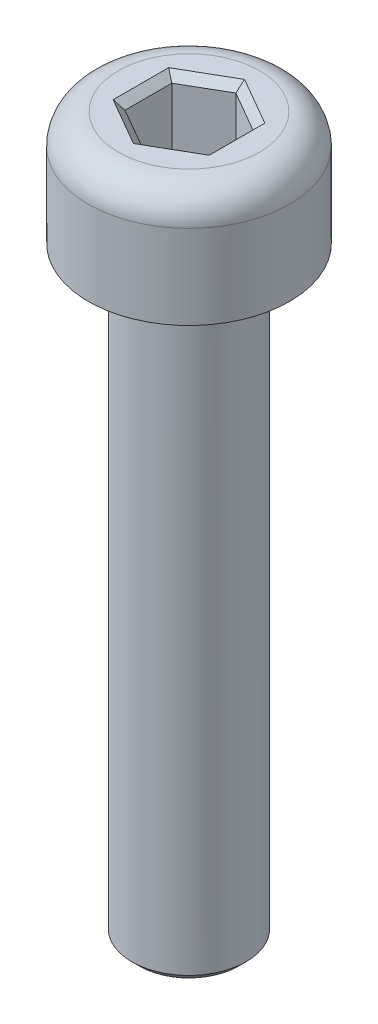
ISO-10303-21;
HEADER;
FILE_DESCRIPTION(('STEP AP214'),'2;1');
FILE_NAME('part.step','',(''),(''),'','','');
FILE_SCHEMA(('AUTOMOTIVE_DESIGN { 1 0 10303 214 1 1 1 1 }'));
ENDSEC;
DATA;
#1=APPLICATION_CONTEXT('core data for automotive mechanical design processes');
#2=APPLICATION_PROTOCOL_DEFINITION('international standard','automotive_design',2000,#1);
#3=PRODUCT_CONTEXT('',#1,'mechanical');
#4=PRODUCT('Part','Part','',(#3));
#5=PRODUCT_RELATED_PRODUCT_CATEGORY('part','',(#4));
#6=PRODUCT_DEFINITION_FORMATION('','',#4);
#7=PRODUCT_DEFINITION_CONTEXT('part definition',#1,'design');
#8=PRODUCT_DEFINITION('design','',#6,#7);
#9=PRODUCT_DEFINITION_SHAPE('','',#8);
#10=(LENGTH_UNIT() NAMED_UNIT(*) SI_UNIT(.MILLI.,.METRE.));
#11=(NAMED_UNIT(*) PLANE_ANGLE_UNIT() SI_UNIT($,.RADIAN.));
#12=(NAMED_UNIT(*) SI_UNIT($,.STERADIAN.) SOLID_ANGLE_UNIT());
#13=UNCERTAINTY_MEASURE_WITH_UNIT(LENGTH_MEASURE(1.E-05),#10,'distance_accuracy_value','');
#14=(GEOMETRIC_REPRESENTATION_CONTEXT(3) GLOBAL_UNCERTAINTY_ASSIGNED_CONTEXT((#13)) GLOBAL_UNIT_ASSIGNED_CONTEXT((#10,
#11,#12)) REPRESENTATION_CONTEXT('',''));
#15=CARTESIAN_POINT('',(0.,0.,0.));
#16=DIRECTION('',(0.,0.,1.));
#17=DIRECTION('',(1.,0.,0.));
#18=AXIS2_PLACEMENT_3D('',#15,#16,#17);
#19=CARTESIAN_POINT('',(0.,0.,0.));
#20=DIRECTION('',(0.,1.,0.));
#21=DIRECTION('',(0.,0.,1.));
#22=AXIS2_PLACEMENT_3D('',#19,#20,#21);
#23=PLANE('',#22);
#24=CARTESIAN_POINT('',(0.,0.,0.));
#25=DIRECTION('',(0.,1.,0.));
#26=DIRECTION('',(0.,0.,1.));
#27=AXIS2_PLACEMENT_3D('',#24,#25,#26);
#28=CIRCLE('',#27,3.35);
#29=CARTESIAN_POINT('',(0.,0.,-3.35));
#30=VERTEX_POINT('',#29);
#31=EDGE_CURVE('E141',#30,#30,#28,.T.);
#32=ORIENTED_EDGE('',*,*,#31,.F.);
#33=EDGE_LOOP('',(#32));
#34=FACE_BOUND('',#33,.T.);
#35=CARTESIAN_POINT('',(0.,0.,0.));
#36=DIRECTION('',(0.,1.,0.));
#37=DIRECTION('',(0.,0.,1.));
#38=AXIS2_PLACEMENT_3D('',#35,#36,#37);
#39=CIRCLE('',#38,1.9);
#40=CARTESIAN_POINT('',(0.,0.,1.9));
#41=VERTEX_POINT('',#40);
#42=EDGE_CURVE('E159',#41,#41,#39,.F.);
#43=ORIENTED_EDGE('',*,*,#42,.F.);
#44=EDGE_LOOP('',(#43));
#45=FACE_BOUND('',#44,.T.);
#46=ADVANCED_FACE('F33',(#34,#45),#23,.F.);
#47=CARTESIAN_POINT('',(0.,3.8,0.));
#48=DIRECTION('',(0.,-1.,0.));
#49=DIRECTION('',(0.,0.,-1.));
#50=AXIS2_PLACEMENT_3D('',#47,#48,#49);
#51=CYLINDRICAL_SURFACE('',#50,3.35);
#52=CARTESIAN_POINT('',(0.,2.8,0.));
#53=DIRECTION('',(0.,1.,0.));
#54=DIRECTION('',(0.,0.,1.));
#55=AXIS2_PLACEMENT_3D('',#52,#53,#54);
#56=CIRCLE('',#55,3.35);
#57=CARTESIAN_POINT('',(0.,2.8,-3.35));
#58=VERTEX_POINT('',#57);
#59=EDGE_CURVE('E156',#58,#58,#56,.F.);
#60=CARTESIAN_POINT('',(0.,2.8,-3.35));
#61=CARTESIAN_POINT('',(0.,2.77083333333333,-3.35));
#62=CARTESIAN_POINT('',(0.,2.74166666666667,-3.35));
#63=CARTESIAN_POINT('',(0.,2.68333333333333,-3.35));
#64=CARTESIAN_POINT('',(0.,2.65416666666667,-3.35));
#65=CARTESIAN_POINT('',(0.,2.59583333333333,-3.35));
#66=CARTESIAN_POINT('',(0.,2.56666666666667,-3.35));
#67=CARTESIAN_POINT('',(0.,2.50833333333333,-3.35));
#68=CARTESIAN_POINT('',(0.,2.47916666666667,-3.35));
#69=CARTESIAN_POINT('',(0.,2.42083333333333,-3.35));
#70=CARTESIAN_POINT('',(0.,2.39166666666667,-3.35));
#71=CARTESIAN_POINT('',(0.,2.33333333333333,-3.35));
#72=CARTESIAN_POINT('',(0.,2.30416666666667,-3.35));
#73=CARTESIAN_POINT('',(0.,2.24583333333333,-3.35));
#74=CARTESIAN_POINT('',(0.,2.21666666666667,-3.35));
#75=CARTESIAN_POINT('',(0.,2.15833333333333,-3.35));
#76=CARTESIAN_POINT('',(0.,2.12916666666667,-3.35));
#77=CARTESIAN_POINT('',(0.,2.07083333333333,-3.35));
#78=CARTESIAN_POINT('',(0.,2.04166666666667,-3.35));
#79=CARTESIAN_POINT('',(0.,1.98333333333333,-3.35));
#80=CARTESIAN_POINT('',(0.,1.95416666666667,-3.35));
#81=CARTESIAN_POINT('',(0.,1.89583333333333,-3.35));
#82=CARTESIAN_POINT('',(0.,1.86666666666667,-3.35));
#83=CARTESIAN_POINT('',(0.,1.80833333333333,-3.35));
#84=CARTESIAN_POINT('',(0.,1.77916666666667,-3.35));
#85=CARTESIAN_POINT('',(0.,1.72083333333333,-3.35));
#86=CARTESIAN_POINT('',(0.,1.69166666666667,-3.35));
#87=CARTESIAN_POINT('',(0.,1.63333333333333,-3.35));
#88=CARTESIAN_POINT('',(0.,1.60416666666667,-3.35));
#89=CARTESIAN_POINT('',(0.,1.54583333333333,-3.35));
#90=CARTESIAN_POINT('',(0.,1.51666666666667,-3.35));
#91=CARTESIAN_POINT('',(0.,1.45833333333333,-3.35));
#92=CARTESIAN_POINT('',(0.,1.42916666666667,-3.35));
#93=CARTESIAN_POINT('',(0.,1.37083333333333,-3.35));
#94=CARTESIAN_POINT('',(0.,1.34166666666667,-3.35));
#95=CARTESIAN_POINT('',(0.,1.28333333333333,-3.35));
#96=CARTESIAN_POINT('',(0.,1.25416666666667,-3.35));
#97=CARTESIAN_POINT('',(0.,1.19583333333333,-3.35));
#98=CARTESIAN_POINT('',(0.,1.16666666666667,-3.35));
#99=CARTESIAN_POINT('',(0.,1.10833333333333,-3.35));
#100=CARTESIAN_POINT('',(0.,1.07916666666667,-3.35));
#101=CARTESIAN_POINT('',(0.,1.02083333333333,-3.35));
#102=CARTESIAN_POINT('',(0.,0.991666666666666,-3.35));
#103=CARTESIAN_POINT('',(0.,0.933333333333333,-3.35));
#104=CARTESIAN_POINT('',(0.,0.904166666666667,-3.35));
#105=CARTESIAN_POINT('',(0.,0.845833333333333,-3.35));
#106=CARTESIAN_POINT('',(0.,0.816666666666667,-3.35));
#107=CARTESIAN_POINT('',(0.,0.758333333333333,-3.35));
#108=CARTESIAN_POINT('',(0.,0.729166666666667,-3.35));
#109=CARTESIAN_POINT('',(0.,0.670833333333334,-3.35));
#110=CARTESIAN_POINT('',(0.,0.641666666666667,-3.35));
#111=CARTESIAN_POINT('',(0.,0.583333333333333,-3.35));
#112=CARTESIAN_POINT('',(0.,0.554166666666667,-3.35));
#113=CARTESIAN_POINT('',(0.,0.495833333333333,-3.35));
#114=CARTESIAN_POINT('',(0.,0.466666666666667,-3.35));
#115=CARTESIAN_POINT('',(0.,0.408333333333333,-3.35));
#116=CARTESIAN_POINT('',(0.,0.379166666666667,-3.35));
#117=CARTESIAN_POINT('',(0.,0.320833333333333,-3.35));
#118=CARTESIAN_POINT('',(0.,0.291666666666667,-3.35));
#119=CARTESIAN_POINT('',(0.,0.233333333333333,-3.35));
#120=CARTESIAN_POINT('',(0.,0.204166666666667,-3.35));
#121=CARTESIAN_POINT('',(0.,0.145833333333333,-3.35));
#122=CARTESIAN_POINT('',(0.,0.116666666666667,-3.35));
#123=CARTESIAN_POINT('',(0.,0.0583333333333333,-3.35));
#124=CARTESIAN_POINT('',(0.,0.0291666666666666,-3.35));
#125=CARTESIAN_POINT('',(0.,0.,-3.35));
#126=B_SPLINE_CURVE_WITH_KNOTS('',3,(#60,#61,#62,#63,#64,#65,#66,#67,#68,#69,#70,#71,#72,#73,
#74,#75,#76,#77,#78,#79,#80,#81,#82,#83,#84,#85,#86,#87,#88,#89,#90,#91,#92,#93,#94,#95,#96,#97,
#98,#99,#100,#101,#102,#103,#104,#105,#106,#107,#108,#109,#110,#111,#112,#113,#114,#115,#116,
#117,#118,#119,#120,#121,#122,#123,#124,#125),.UNSPECIFIED.,.F.,.F.,(4,2,2,2,2,2,2,2,2,2,2,2,2,
2,2,2,2,2,2,2,2,2,2,2,2,2,2,2,2,2,2,2,4),(0.,0.0874999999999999,0.175,0.2625,0.35,0.4375,
0.524999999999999,0.6125,0.7,0.7875,0.875,0.9625,1.05,1.1375,1.225,1.3125,1.4,1.4875,1.575,
1.6625,1.75,1.8375,1.925,2.0125,2.1,2.1875,2.275,2.3625,2.45,2.5375,2.625,2.7125,2.8),.UNSPECIFIED.);
#127=EDGE_CURVE('BSEAM213',#58,#30,#126,.T.);
#128=ORIENTED_EDGE('',*,*,#59,.T.);
#129=ORIENTED_EDGE('',*,*,#31,.T.);
#130=ORIENTED_EDGE('',*,*,#127,.T.);
#131=ORIENTED_EDGE('',*,*,#127,.F.);
#132=EDGE_LOOP('',(#128,#130,#129,#131));
#133=FACE_BOUND('',#132,.T.);
#134=ADVANCED_FACE('F213',(#133),#51,.T.);
#135=CARTESIAN_POINT('',(0.,3.8,0.));
#136=DIRECTION('',(0.,1.,0.));
#137=DIRECTION('',(0.,0.,1.));
#138=AXIS2_PLACEMENT_3D('',#135,#136,#137);
#139=PLANE('',#138);
#140=DIRECTION('',(-0.866025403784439,0.,-0.5));
#141=VECTOR('',#140,1.);
#142=CARTESIAN_POINT('',(-1.475,3.8,0.995929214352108));
#143=LINE('',#142,#141);
#144=CARTESIAN_POINT('',(0.,3.8,1.84752086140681));
#145=VERTEX_POINT('',#144);
#146=CARTESIAN_POINT('',(-1.6,3.8,0.923760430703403));
#147=VERTEX_POINT('',#146);
#148=EDGE_CURVE('E173',#145,#147,#143,.T.);
#149=ORIENTED_EDGE('',*,*,#148,.T.);
#150=DIRECTION('',(0.,0.,-1.));
#151=VECTOR('',#150,1.);
#152=CARTESIAN_POINT('',(-1.6,3.8,-0.779422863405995));
#153=LINE('',#152,#151);
#154=CARTESIAN_POINT('',(-1.6,3.8,-0.923760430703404));
#155=VERTEX_POINT('',#154);
#156=EDGE_CURVE('E175',#147,#155,#153,.T.);
#157=ORIENTED_EDGE('',*,*,#156,.T.);
#158=DIRECTION('',(0.866025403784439,0.,-0.5));
#159=VECTOR('',#158,1.);
#160=CARTESIAN_POINT('',(-0.125000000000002,3.8,-1.7753520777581));
#161=LINE('',#160,#159);
#162=CARTESIAN_POINT('',(0.,3.8,-1.84752086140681));
#163=VERTEX_POINT('',#162);
#164=EDGE_CURVE('E165',#155,#163,#161,.T.);
#165=ORIENTED_EDGE('',*,*,#164,.T.);
#166=DIRECTION('',(0.866025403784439,0.,0.5));
#167=VECTOR('',#166,1.);
#168=CARTESIAN_POINT('',(1.475,3.8,-0.995929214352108));
#169=LINE('',#168,#167);
#170=CARTESIAN_POINT('',(1.6,3.8,-0.923760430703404));
#171=VERTEX_POINT('',#170);
#172=EDGE_CURVE('E167',#163,#171,#169,.T.);
#173=ORIENTED_EDGE('',*,*,#172,.T.);
#174=DIRECTION('',(0.,0.,1.));
#175=VECTOR('',#174,1.);
#176=CARTESIAN_POINT('',(1.6,3.8,0.779422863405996));
#177=LINE('',#176,#175);
#178=CARTESIAN_POINT('',(1.6,3.8,0.923760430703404));
#179=VERTEX_POINT('',#178);
#180=EDGE_CURVE('E169',#171,#179,#177,.T.);
#181=ORIENTED_EDGE('',*,*,#180,.T.);
#182=DIRECTION('',(-0.866025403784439,0.,0.5));
#183=VECTOR('',#182,1.);
#184=CARTESIAN_POINT('',(0.125000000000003,3.8,1.7753520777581));
#185=LINE('',#184,#183);
#186=EDGE_CURVE('E171',#179,#145,#185,.T.);
#187=ORIENTED_EDGE('',*,*,#186,.T.);
#188=EDGE_LOOP('',(#149,#157,#165,#173,#181,#187));
#189=FACE_BOUND('',#188,.T.);
#190=CARTESIAN_POINT('',(0.,3.8,0.));
#191=DIRECTION('',(0.,1.,0.));
#192=DIRECTION('',(0.,0.,1.));
#193=AXIS2_PLACEMENT_3D('',#190,#191,#192);
#194=CIRCLE('',#193,2.35);
#195=CARTESIAN_POINT('',(0.,3.8,2.35));
#196=VERTEX_POINT('',#195);
#197=EDGE_CURVE('E153',#196,#196,#194,.T.);
#198=ORIENTED_EDGE('',*,*,#197,.T.);
#199=EDGE_LOOP('',(#198));
#200=FACE_BOUND('',#199,.T.);
#201=ADVANCED_FACE('F219',(#189,#200),#139,.T.);
#202=CARTESIAN_POINT('',(0.,2.8,0.));
#203=DIRECTION('',(0.,1.,0.));
#204=DIRECTION('',(0.,0.,1.));
#205=AXIS2_PLACEMENT_3D('',#202,#203,#204);
#206=TOROIDAL_SURFACE('',#205,2.35,1.);
#207=ORIENTED_EDGE('',*,*,#59,.F.);
#208=EDGE_LOOP('',(#207));
#209=FACE_BOUND('',#208,.T.);
#210=ORIENTED_EDGE('',*,*,#197,.F.);
#211=EDGE_LOOP('',(#210));
#212=FACE_BOUND('',#211,.T.);
#213=ADVANCED_FACE('F227',(#209,#212),#206,.T.);
#214=CARTESIAN_POINT('',(0.,-20.,0.));
#215=DIRECTION('',(0.,1.,0.));
#216=DIRECTION('',(0.,0.,1.));
#217=AXIS2_PLACEMENT_3D('',#214,#215,#216);
#218=CYLINDRICAL_SURFACE('',#217,1.9);
#219=CARTESIAN_POINT('',(0.,-19.75,0.));
#220=DIRECTION('',(0.,-1.,0.));
#221=DIRECTION('',(0.,0.,-1.));
#222=AXIS2_PLACEMENT_3D('',#219,#220,#221);
#223=CIRCLE('',#222,1.9);
#224=CARTESIAN_POINT('',(0.,-19.75,-1.9));
#225=VERTEX_POINT('',#224);
#226=EDGE_CURVE('E11',#225,#225,#223,.F.);
#227=ORIENTED_EDGE('',*,*,#226,.T.);
#228=EDGE_LOOP('',(#227));
#229=FACE_BOUND('',#228,.T.);
#230=ORIENTED_EDGE('',*,*,#42,.T.);
#231=EDGE_LOOP('',(#230));
#232=FACE_BOUND('',#231,.T.);
#233=ADVANCED_FACE('F229',(#229,#232),#218,.T.);
#234=CARTESIAN_POINT('',(0.,-20.,0.));
#235=DIRECTION('',(0.,-1.,0.));
#236=DIRECTION('',(0.,0.,-1.));
#237=AXIS2_PLACEMENT_3D('',#234,#235,#236);
#238=PLANE('',#237);
#239=CARTESIAN_POINT('',(0.,-20.,0.));
#240=DIRECTION('',(0.,-1.,0.));
#241=DIRECTION('',(0.,0.,-1.));
#242=AXIS2_PLACEMENT_3D('',#239,#240,#241);
#243=CIRCLE('',#242,1.65);
#244=CARTESIAN_POINT('',(0.,-20.,-1.65));
#245=VERTEX_POINT('',#244);
#246=EDGE_CURVE('E41',#245,#245,#243,.T.);
#247=ORIENTED_EDGE('',*,*,#246,.T.);
#248=EDGE_LOOP('',(#247));
#249=FACE_BOUND('',#248,.T.);
#250=ADVANCED_FACE('F200',(#249),#238,.T.);
#251=CARTESIAN_POINT('',(1.35,0.8,-0.779422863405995));
#252=DIRECTION('',(0.5,0.,-0.866025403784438));
#253=DIRECTION('',(-0.866025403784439,0.,-0.5));
#254=AXIS2_PLACEMENT_3D('',#251,#252,#253);
#255=PLANE('',#254);
#256=DIRECTION('',(0.,1.,0.));
#257=VECTOR('',#256,1.);
#258=CARTESIAN_POINT('',(1.35,0.8,-0.779422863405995));
#259=LINE('',#258,#257);
#260=CARTESIAN_POINT('',(1.35,0.8,-0.779422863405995));
#261=VERTEX_POINT('',#260);
#262=CARTESIAN_POINT('',(1.35,3.55,-0.779422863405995));
#263=VERTEX_POINT('',#262);
#264=EDGE_CURVE('E139',#261,#263,#259,.T.);
#265=ORIENTED_EDGE('',*,*,#264,.T.);
#266=DIRECTION('',(-0.866025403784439,0.,-0.5));
#267=VECTOR('',#266,1.);
#268=CARTESIAN_POINT('',(0.,3.55,-1.55884572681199));
#269=LINE('',#268,#267);
#270=CARTESIAN_POINT('',(0.,3.55,-1.55884572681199));
#271=VERTEX_POINT('',#270);
#272=EDGE_CURVE('E48',#263,#271,#269,.T.);
#273=ORIENTED_EDGE('',*,*,#272,.T.);
#274=DIRECTION('',(0.,1.,0.));
#275=VECTOR('',#274,1.);
#276=CARTESIAN_POINT('',(0.,0.8,-1.55884572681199));
#277=LINE('',#276,#275);
#278=CARTESIAN_POINT('',(0.,0.8,-1.55884572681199));
#279=VERTEX_POINT('',#278);
#280=EDGE_CURVE('E103',#279,#271,#277,.T.);
#281=ORIENTED_EDGE('',*,*,#280,.F.);
#282=DIRECTION('',(-0.866025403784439,0.,-0.5));
#283=VECTOR('',#282,1.);
#284=CARTESIAN_POINT('',(1.35,0.8,-0.779422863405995));
#285=LINE('',#284,#283);
#286=EDGE_CURVE('E107',#261,#279,#285,.T.);
#287=ORIENTED_EDGE('',*,*,#286,.F.);
#288=EDGE_LOOP('',(#265,#273,#281,#287));
#289=FACE_BOUND('',#288,.T.);
#290=ADVANCED_FACE('F105',(#289),#255,.F.);
#291=CARTESIAN_POINT('',(1.35,0.8,0.779422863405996));
#292=DIRECTION('',(1.,0.,0.));
#293=DIRECTION('',(0.,0.,-1.));
#294=AXIS2_PLACEMENT_3D('',#291,#292,#293);
#295=PLANE('',#294);
#296=DIRECTION('',(0.,1.,0.));
#297=VECTOR('',#296,1.);
#298=CARTESIAN_POINT('',(1.35,0.8,0.779422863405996));
#299=LINE('',#298,#297);
#300=CARTESIAN_POINT('',(1.35,0.8,0.779422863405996));
#301=VERTEX_POINT('',#300);
#302=CARTESIAN_POINT('',(1.35,3.55,0.779422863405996));
#303=VERTEX_POINT('',#302);
#304=EDGE_CURVE('E142',#301,#303,#299,.T.);
#305=ORIENTED_EDGE('',*,*,#304,.T.);
#306=DIRECTION('',(0.,0.,-1.));
#307=VECTOR('',#306,1.);
#308=CARTESIAN_POINT('',(1.35,3.55,-0.779422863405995));
#309=LINE('',#308,#307);
#310=EDGE_CURVE('E56',#303,#263,#309,.T.);
#311=ORIENTED_EDGE('',*,*,#310,.T.);
#312=ORIENTED_EDGE('',*,*,#264,.F.);
#313=DIRECTION('',(0.,0.,-1.));
#314=VECTOR('',#313,1.);
#315=CARTESIAN_POINT('',(1.35,0.8,0.779422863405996));
#316=LINE('',#315,#314);
#317=EDGE_CURVE('E112',#301,#261,#316,.T.);
#318=ORIENTED_EDGE('',*,*,#317,.F.);
#319=EDGE_LOOP('',(#305,#311,#312,#318));
#320=FACE_BOUND('',#319,.T.);
#321=ADVANCED_FACE('F277',(#320),#295,.F.);
#322=CARTESIAN_POINT('',(0.,0.8,1.55884572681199));
#323=DIRECTION('',(0.5,0.,0.866025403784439));
#324=DIRECTION('',(0.866025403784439,0.,-0.5));
#325=AXIS2_PLACEMENT_3D('',#322,#323,#324);
#326=PLANE('',#325);
#327=DIRECTION('',(0.,1.,0.));
#328=VECTOR('',#327,1.);
#329=CARTESIAN_POINT('',(0.,0.8,1.55884572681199));
#330=LINE('',#329,#328);
#331=CARTESIAN_POINT('',(0.,0.8,1.55884572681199));
#332=VERTEX_POINT('',#331);
#333=CARTESIAN_POINT('',(0.,3.55,1.55884572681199));
#334=VERTEX_POINT('',#333);
#335=EDGE_CURVE('E144',#332,#334,#330,.T.);
#336=ORIENTED_EDGE('',*,*,#335,.T.);
#337=DIRECTION('',(0.866025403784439,0.,-0.5));
#338=VECTOR('',#337,1.);
#339=CARTESIAN_POINT('',(1.35,3.55,0.779422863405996));
#340=LINE('',#339,#338);
#341=EDGE_CURVE('E180',#334,#303,#340,.T.);
#342=ORIENTED_EDGE('',*,*,#341,.T.);
#343=ORIENTED_EDGE('',*,*,#304,.F.);
#344=DIRECTION('',(0.866025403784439,0.,-0.5));
#345=VECTOR('',#344,1.);
#346=CARTESIAN_POINT('',(0.,0.8,1.55884572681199));
#347=LINE('',#346,#345);
#348=EDGE_CURVE('E136',#332,#301,#347,.T.);
#349=ORIENTED_EDGE('',*,*,#348,.F.);
#350=EDGE_LOOP('',(#336,#342,#343,#349));
#351=FACE_BOUND('',#350,.T.);
#352=ADVANCED_FACE('F276',(#351),#326,.F.);
#353=CARTESIAN_POINT('',(-1.35,0.8,0.779422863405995));
#354=DIRECTION('',(-0.5,0.,0.866025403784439));
#355=DIRECTION('',(0.866025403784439,0.,0.5));
#356=AXIS2_PLACEMENT_3D('',#353,#354,#355);
#357=PLANE('',#356);
#358=DIRECTION('',(0.,1.,0.));
#359=VECTOR('',#358,1.);
#360=CARTESIAN_POINT('',(-1.35,0.8,0.779422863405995));
#361=LINE('',#360,#359);
#362=CARTESIAN_POINT('',(-1.35,0.8,0.779422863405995));
#363=VERTEX_POINT('',#362);
#364=CARTESIAN_POINT('',(-1.35,3.55,0.779422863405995));
#365=VERTEX_POINT('',#364);
#366=EDGE_CURVE('E147',#363,#365,#361,.T.);
#367=ORIENTED_EDGE('',*,*,#366,.T.);
#368=DIRECTION('',(0.866025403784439,0.,0.5));
#369=VECTOR('',#368,1.);
#370=CARTESIAN_POINT('',(0.,3.55,1.55884572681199));
#371=LINE('',#370,#369);
#372=EDGE_CURVE('E178',#365,#334,#371,.T.);
#373=ORIENTED_EDGE('',*,*,#372,.T.);
#374=ORIENTED_EDGE('',*,*,#335,.F.);
#375=DIRECTION('',(0.866025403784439,0.,0.5));
#376=VECTOR('',#375,1.);
#377=CARTESIAN_POINT('',(-1.35,0.8,0.779422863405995));
#378=LINE('',#377,#376);
#379=EDGE_CURVE('E133',#363,#332,#378,.T.);
#380=ORIENTED_EDGE('',*,*,#379,.F.);
#381=EDGE_LOOP('',(#367,#373,#374,#380));
#382=FACE_BOUND('',#381,.T.);
#383=ADVANCED_FACE('F273',(#382),#357,.F.);
#384=CARTESIAN_POINT('',(-1.35,0.8,-0.779422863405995));
#385=DIRECTION('',(-1.,0.,0.));
#386=DIRECTION('',(0.,0.,1.));
#387=AXIS2_PLACEMENT_3D('',#384,#385,#386);
#388=PLANE('',#387);
#389=DIRECTION('',(0.,1.,0.));
#390=VECTOR('',#389,1.);
#391=CARTESIAN_POINT('',(-1.35,0.8,-0.779422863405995));
#392=LINE('',#391,#390);
#393=CARTESIAN_POINT('',(-1.35,0.8,-0.779422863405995));
#394=VERTEX_POINT('',#393);
#395=CARTESIAN_POINT('',(-1.35,3.55,-0.779422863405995));
#396=VERTEX_POINT('',#395);
#397=EDGE_CURVE('E111',#394,#396,#392,.T.);
#398=ORIENTED_EDGE('',*,*,#397,.T.);
#399=DIRECTION('',(0.,0.,1.));
#400=VECTOR('',#399,1.);
#401=CARTESIAN_POINT('',(-1.35,3.55,0.779422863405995));
#402=LINE('',#401,#400);
#403=EDGE_CURVE('E162',#396,#365,#402,.T.);
#404=ORIENTED_EDGE('',*,*,#403,.T.);
#405=ORIENTED_EDGE('',*,*,#366,.F.);
#406=DIRECTION('',(0.,0.,1.));
#407=VECTOR('',#406,1.);
#408=CARTESIAN_POINT('',(-1.35,0.8,-0.779422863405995));
#409=LINE('',#408,#407);
#410=EDGE_CURVE('E121',#394,#363,#409,.T.);
#411=ORIENTED_EDGE('',*,*,#410,.F.);
#412=EDGE_LOOP('',(#398,#404,#405,#411));
#413=FACE_BOUND('',#412,.T.);
#414=ADVANCED_FACE('F269',(#413),#388,.F.);
#415=CARTESIAN_POINT('',(0.,0.8,-1.55884572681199));
#416=DIRECTION('',(-0.5,0.,-0.866025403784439));
#417=DIRECTION('',(-0.866025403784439,0.,0.5));
#418=AXIS2_PLACEMENT_3D('',#415,#416,#417);
#419=PLANE('',#418);
#420=ORIENTED_EDGE('',*,*,#280,.T.);
#421=DIRECTION('',(-0.866025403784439,0.,0.5));
#422=VECTOR('',#421,1.);
#423=CARTESIAN_POINT('',(-1.35,3.55,-0.779422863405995));
#424=LINE('',#423,#422);
#425=EDGE_CURVE('E184',#271,#396,#424,.T.);
#426=ORIENTED_EDGE('',*,*,#425,.T.);
#427=ORIENTED_EDGE('',*,*,#397,.F.);
#428=DIRECTION('',(-0.866025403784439,0.,0.5));
#429=VECTOR('',#428,1.);
#430=CARTESIAN_POINT('',(0.,0.8,-1.55884572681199));
#431=LINE('',#430,#429);
#432=EDGE_CURVE('E115',#279,#394,#431,.T.);
#433=ORIENTED_EDGE('',*,*,#432,.F.);
#434=EDGE_LOOP('',(#420,#426,#427,#433));
#435=FACE_BOUND('',#434,.T.);
#436=ADVANCED_FACE('F116',(#435),#419,.F.);
#437=CARTESIAN_POINT('',(0.,0.8,0.));
#438=DIRECTION('',(0.,1.,0.));
#439=DIRECTION('',(0.,0.,1.));
#440=AXIS2_PLACEMENT_3D('',#437,#438,#439);
#441=PLANE('',#440);
#442=ORIENTED_EDGE('',*,*,#286,.T.);
#443=ORIENTED_EDGE('',*,*,#432,.T.);
#444=ORIENTED_EDGE('',*,*,#410,.T.);
#445=ORIENTED_EDGE('',*,*,#379,.T.);
#446=ORIENTED_EDGE('',*,*,#348,.T.);
#447=ORIENTED_EDGE('',*,*,#317,.T.);
#448=EDGE_LOOP('',(#442,#443,#444,#445,#446,#447));
#449=FACE_BOUND('',#448,.T.);
#450=ADVANCED_FACE('F123',(#449),#441,.T.);
#451=CARTESIAN_POINT('',(1.35,3.55,0.779422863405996));
#452=DIRECTION('',(-0.707106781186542,0.707106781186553,0.));
#453=DIRECTION('',(0.,0.,1.));
#454=AXIS2_PLACEMENT_3D('',#451,#452,#453);
#455=PLANE('',#454);
#456=DIRECTION('',(0.654653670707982,0.654653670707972,0.377964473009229));
#457=VECTOR('',#456,1.);
#458=CARTESIAN_POINT('',(0.964285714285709,3.16428571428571,0.556730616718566));
#459=LINE('',#458,#457);
#460=EDGE_CURVE('E129',#179,#303,#459,.F.);
#461=ORIENTED_EDGE('',*,*,#460,.F.);
#462=ORIENTED_EDGE('',*,*,#180,.F.);
#463=DIRECTION('',(0.654653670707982,0.654653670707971,-0.37796447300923));
#464=VECTOR('',#463,1.);
#465=CARTESIAN_POINT('',(0.964285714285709,3.16428571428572,-0.556730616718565));
#466=LINE('',#465,#464);
#467=EDGE_CURVE('E126',#263,#171,#466,.T.);
#468=ORIENTED_EDGE('',*,*,#467,.F.);
#469=ORIENTED_EDGE('',*,*,#310,.F.);
#470=EDGE_LOOP('',(#461,#462,#468,#469));
#471=FACE_BOUND('',#470,.T.);
#472=ADVANCED_FACE('F245',(#471),#455,.T.);
#473=CARTESIAN_POINT('',(1.35,3.55,-0.779422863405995));
#474=DIRECTION('',(-0.353553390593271,0.707106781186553,0.61237243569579));
#475=DIRECTION('',(0.866025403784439,0.,0.5));
#476=AXIS2_PLACEMENT_3D('',#473,#474,#475);
#477=PLANE('',#476);
#478=ORIENTED_EDGE('',*,*,#467,.T.);
#479=ORIENTED_EDGE('',*,*,#172,.F.);
#480=DIRECTION('',(0.,0.654653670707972,-0.755928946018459));
#481=VECTOR('',#480,1.);
#482=CARTESIAN_POINT('',(0.,3.16428571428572,-1.11346123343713));
#483=LINE('',#482,#481);
#484=EDGE_CURVE('E193',#271,#163,#483,.T.);
#485=ORIENTED_EDGE('',*,*,#484,.F.);
#486=ORIENTED_EDGE('',*,*,#272,.F.);
#487=EDGE_LOOP('',(#478,#479,#485,#486));
#488=FACE_BOUND('',#487,.T.);
#489=ADVANCED_FACE('F242',(#488),#477,.T.);
#490=CARTESIAN_POINT('',(0.,3.55,1.55884572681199));
#491=DIRECTION('',(-0.353553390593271,0.707106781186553,-0.61237243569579));
#492=DIRECTION('',(-0.866025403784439,0.,0.5));
#493=AXIS2_PLACEMENT_3D('',#490,#491,#492);
#494=PLANE('',#493);
#495=ORIENTED_EDGE('',*,*,#460,.T.);
#496=ORIENTED_EDGE('',*,*,#341,.F.);
#497=DIRECTION('',(0.,0.654653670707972,0.755928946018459));
#498=VECTOR('',#497,1.);
#499=CARTESIAN_POINT('',(0.,3.16428571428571,1.11346123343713));
#500=LINE('',#499,#498);
#501=EDGE_CURVE('E190',#145,#334,#500,.F.);
#502=ORIENTED_EDGE('',*,*,#501,.F.);
#503=ORIENTED_EDGE('',*,*,#186,.F.);
#504=EDGE_LOOP('',(#495,#496,#502,#503));
#505=FACE_BOUND('',#504,.T.);
#506=ADVANCED_FACE('F238',(#505),#494,.T.);
#507=CARTESIAN_POINT('',(0.,3.55,-1.55884572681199));
#508=DIRECTION('',(0.353553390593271,0.707106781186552,0.61237243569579));
#509=DIRECTION('',(0.866025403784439,0.,-0.5));
#510=AXIS2_PLACEMENT_3D('',#507,#508,#509);
#511=PLANE('',#510);
#512=ORIENTED_EDGE('',*,*,#484,.T.);
#513=ORIENTED_EDGE('',*,*,#164,.F.);
#514=DIRECTION('',(0.654653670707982,-0.654653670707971,0.377964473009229));
#515=VECTOR('',#514,1.);
#516=CARTESIAN_POINT('',(-1.35,3.55,-0.779422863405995));
#517=LINE('',#516,#515);
#518=EDGE_CURVE('E188',#396,#155,#517,.F.);
#519=ORIENTED_EDGE('',*,*,#518,.F.);
#520=ORIENTED_EDGE('',*,*,#425,.F.);
#521=EDGE_LOOP('',(#512,#513,#519,#520));
#522=FACE_BOUND('',#521,.T.);
#523=ADVANCED_FACE('F234',(#522),#511,.T.);
#524=CARTESIAN_POINT('',(-1.35,3.55,0.779422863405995));
#525=DIRECTION('',(0.353553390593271,0.707106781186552,-0.612372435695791));
#526=DIRECTION('',(-0.866025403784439,0.,-0.5));
#527=AXIS2_PLACEMENT_3D('',#524,#525,#526);
#528=PLANE('',#527);
#529=ORIENTED_EDGE('',*,*,#501,.T.);
#530=ORIENTED_EDGE('',*,*,#372,.F.);
#531=DIRECTION('',(-0.654653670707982,0.654653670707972,0.377964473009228));
#532=VECTOR('',#531,1.);
#533=CARTESIAN_POINT('',(-0.964285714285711,3.16428571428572,0.556730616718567));
#534=LINE('',#533,#532);
#535=EDGE_CURVE('E186',#147,#365,#534,.F.);
#536=ORIENTED_EDGE('',*,*,#535,.F.);
#537=ORIENTED_EDGE('',*,*,#148,.F.);
#538=EDGE_LOOP('',(#529,#530,#536,#537));
#539=FACE_BOUND('',#538,.T.);
#540=ADVANCED_FACE('F208',(#539),#528,.T.);
#541=CARTESIAN_POINT('',(-1.35,3.55,-0.779422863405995));
#542=DIRECTION('',(0.707106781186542,0.707106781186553,0.));
#543=DIRECTION('',(0.,0.,-1.));
#544=AXIS2_PLACEMENT_3D('',#541,#542,#543);
#545=PLANE('',#544);
#546=ORIENTED_EDGE('',*,*,#518,.T.);
#547=ORIENTED_EDGE('',*,*,#156,.F.);
#548=ORIENTED_EDGE('',*,*,#535,.T.);
#549=ORIENTED_EDGE('',*,*,#403,.F.);
#550=EDGE_LOOP('',(#546,#547,#548,#549));
#551=FACE_BOUND('',#550,.T.);
#552=ADVANCED_FACE('F203',(#551),#545,.T.);
#553=CARTESIAN_POINT('',(0.,-20.,0.));
#554=DIRECTION('',(0.,1.,0.));
#555=DIRECTION('',(0.,0.,1.));
#556=AXIS2_PLACEMENT_3D('',#553,#554,#555);
#557=CONICAL_SURFACE('',#556,1.65,0.78539816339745);
#558=ORIENTED_EDGE('',*,*,#226,.F.);
#559=EDGE_LOOP('',(#558));
#560=FACE_BOUND('',#559,.T.);
#561=ORIENTED_EDGE('',*,*,#246,.F.);
#562=EDGE_LOOP('',(#561));
#563=FACE_BOUND('',#562,.T.);
#564=ADVANCED_FACE('F35',(#560,#563),#557,.T.);
#565=CLOSED_SHELL('',(#46,#134,#201,#213,#233,#250,#290,#321,#352,#383,#414,#436,#450,#472,#489,
#506,#523,#540,#552,#564));
#566=MANIFOLD_SOLID_BREP('B2',#565);
#567=ADVANCED_BREP_SHAPE_REPRESENTATION('',(#18,#566),#14);
#568=SHAPE_DEFINITION_REPRESENTATION(#9,#567);
ENDSEC;
END-ISO-10303-21;
